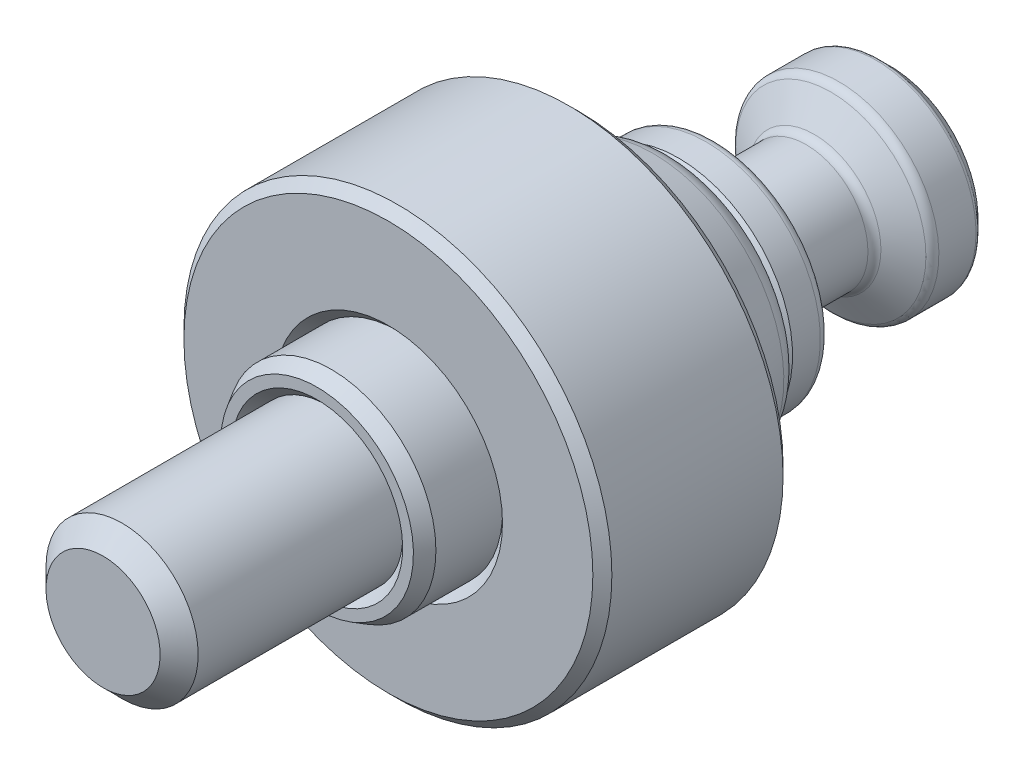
ISO-10303-21;
HEADER;
FILE_DESCRIPTION(('STEP AP214'),'2;1');
FILE_NAME('part.step','',(''),(''),'','','');
FILE_SCHEMA(('AUTOMOTIVE_DESIGN { 1 0 10303 214 1 1 1 1 }'));
ENDSEC;
DATA;
#1=APPLICATION_CONTEXT('core data for automotive mechanical design processes');
#2=APPLICATION_PROTOCOL_DEFINITION('international standard','automotive_design',2000,#1);
#3=PRODUCT_CONTEXT('',#1,'mechanical');
#4=PRODUCT('Part','Part','',(#3));
#5=PRODUCT_RELATED_PRODUCT_CATEGORY('part','',(#4));
#6=PRODUCT_DEFINITION_FORMATION('','',#4);
#7=PRODUCT_DEFINITION_CONTEXT('part definition',#1,'design');
#8=PRODUCT_DEFINITION('design','',#6,#7);
#9=PRODUCT_DEFINITION_SHAPE('','',#8);
#10=(LENGTH_UNIT() NAMED_UNIT(*) SI_UNIT(.MILLI.,.METRE.));
#11=(NAMED_UNIT(*) PLANE_ANGLE_UNIT() SI_UNIT($,.RADIAN.));
#12=(NAMED_UNIT(*) SI_UNIT($,.STERADIAN.) SOLID_ANGLE_UNIT());
#13=UNCERTAINTY_MEASURE_WITH_UNIT(LENGTH_MEASURE(1.E-05),#10,'distance_accuracy_value','');
#14=(GEOMETRIC_REPRESENTATION_CONTEXT(3) GLOBAL_UNCERTAINTY_ASSIGNED_CONTEXT((#13)) GLOBAL_UNIT_ASSIGNED_CONTEXT((#10,
#11,#12)) REPRESENTATION_CONTEXT('',''));
#15=CARTESIAN_POINT('',(0.,0.,0.));
#16=DIRECTION('',(0.,0.,1.));
#17=DIRECTION('',(1.,0.,0.));
#18=AXIS2_PLACEMENT_3D('',#15,#16,#17);
#19=CARTESIAN_POINT('',(0.,0.,20.));
#20=DIRECTION('',(0.,0.,1.));
#21=DIRECTION('',(-1.,0.,0.));
#22=AXIS2_PLACEMENT_3D('',#19,#20,#21);
#23=CONICAL_SURFACE('',#22,12.,0.785398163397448);
#24=CARTESIAN_POINT('',(0.,0.,19.));
#25=DIRECTION('',(0.,0.,1.));
#26=DIRECTION('',(-1.,0.,0.));
#27=AXIS2_PLACEMENT_3D('',#24,#25,#26);
#28=CIRCLE('',#27,11.);
#29=CARTESIAN_POINT('',(-11.,0.,19.));
#30=VERTEX_POINT('',#29);
#31=EDGE_CURVE('E724',#30,#30,#28,.T.);
#32=ORIENTED_EDGE('',*,*,#31,.F.);
#33=EDGE_LOOP('',(#32));
#34=FACE_BOUND('',#33,.T.);
#35=CARTESIAN_POINT('',(0.,0.,20.));
#36=DIRECTION('',(0.,0.,1.));
#37=DIRECTION('',(-1.,0.,0.));
#38=AXIS2_PLACEMENT_3D('',#35,#36,#37);
#39=CIRCLE('',#38,12.);
#40=CARTESIAN_POINT('',(-12.,0.,20.));
#41=VERTEX_POINT('',#40);
#42=EDGE_CURVE('E730',#41,#41,#39,.F.);
#43=ORIENTED_EDGE('',*,*,#42,.F.);
#44=EDGE_LOOP('',(#43));
#45=FACE_BOUND('',#44,.T.);
#46=ADVANCED_FACE('F15',(#34,#45),#23,.F.);
#47=CARTESIAN_POINT('',(11.0000000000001,0.,20.));
#48=DIRECTION('',(0.,0.,1.));
#49=DIRECTION('',(-1.,0.,0.));
#50=AXIS2_PLACEMENT_3D('',#47,#48,#49);
#51=PLANE('',#50);
#52=ORIENTED_EDGE('',*,*,#42,.T.);
#53=EDGE_LOOP('',(#52));
#54=FACE_BOUND('',#53,.T.);
#55=CARTESIAN_POINT('',(0.,0.,20.));
#56=DIRECTION('',(0.,0.,1.));
#57=DIRECTION('',(-1.,0.,0.));
#58=AXIS2_PLACEMENT_3D('',#55,#56,#57);
#59=CIRCLE('',#58,21.5);
#60=CARTESIAN_POINT('',(-21.5,0.,20.));
#61=VERTEX_POINT('',#60);
#62=EDGE_CURVE('E716',#61,#61,#59,.T.);
#63=ORIENTED_EDGE('',*,*,#62,.T.);
#64=EDGE_LOOP('',(#63));
#65=FACE_BOUND('',#64,.T.);
#66=ADVANCED_FACE('F313',(#54,#65),#51,.T.);
#67=CARTESIAN_POINT('',(0.,0.,19.));
#68=DIRECTION('',(0.,0.,-1.));
#69=DIRECTION('',(1.,0.,0.));
#70=AXIS2_PLACEMENT_3D('',#67,#68,#69);
#71=CONICAL_SURFACE('',#70,22.5,0.78539816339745);
#72=ORIENTED_EDGE('',*,*,#62,.F.);
#73=EDGE_LOOP('',(#72));
#74=FACE_BOUND('',#73,.T.);
#75=CARTESIAN_POINT('',(0.,0.,19.));
#76=DIRECTION('',(0.,0.,1.));
#77=DIRECTION('',(-1.,0.,0.));
#78=AXIS2_PLACEMENT_3D('',#75,#76,#77);
#79=CIRCLE('',#78,22.5);
#80=CARTESIAN_POINT('',(-22.5,0.,19.));
#81=VERTEX_POINT('',#80);
#82=EDGE_CURVE('E712',#81,#81,#79,.F.);
#83=ORIENTED_EDGE('',*,*,#82,.F.);
#84=EDGE_LOOP('',(#83));
#85=FACE_BOUND('',#84,.T.);
#86=ADVANCED_FACE('F324',(#74,#85),#71,.T.);
#87=CARTESIAN_POINT('',(22.5,0.,-1.19379064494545E-13));
#88=DIRECTION('',(0.,0.,-1.));
#89=DIRECTION('',(1.,0.,0.));
#90=AXIS2_PLACEMENT_3D('',#87,#88,#89);
#91=PLANE('',#90);
#92=CARTESIAN_POINT('',(0.,0.,-1.19370659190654E-13));
#93=DIRECTION('',(0.,0.,-1.));
#94=DIRECTION('',(-1.,0.,0.));
#95=AXIS2_PLACEMENT_3D('',#92,#93,#94);
#96=CIRCLE('',#95,15.55);
#97=CARTESIAN_POINT('',(-15.55,0.,-1.19370659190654E-13));
#98=VERTEX_POINT('',#97);
#99=EDGE_CURVE('E9',#98,#98,#96,.T.);
#100=ORIENTED_EDGE('',*,*,#99,.F.);
#101=EDGE_LOOP('',(#100));
#102=FACE_BOUND('',#101,.T.);
#103=CARTESIAN_POINT('',(0.,0.,-1.19379064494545E-13));
#104=DIRECTION('',(0.,0.,-1.));
#105=DIRECTION('',(1.,0.,0.));
#106=AXIS2_PLACEMENT_3D('',#103,#104,#105);
#107=CIRCLE('',#106,21.5);
#108=CARTESIAN_POINT('',(21.5,0.,-1.19379064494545E-13));
#109=VERTEX_POINT('',#108);
#110=EDGE_CURVE('E721',#109,#109,#107,.T.);
#111=ORIENTED_EDGE('',*,*,#110,.T.);
#112=EDGE_LOOP('',(#111));
#113=FACE_BOUND('',#112,.T.);
#114=ADVANCED_FACE('F322',(#102,#113),#91,.T.);
#115=CARTESIAN_POINT('',(0.,0.,-1.19379064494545E-13));
#116=DIRECTION('',(0.,0.,1.));
#117=DIRECTION('',(-1.,0.,0.));
#118=AXIS2_PLACEMENT_3D('',#115,#116,#117);
#119=CONICAL_SURFACE('',#118,21.5,0.785398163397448);
#120=CARTESIAN_POINT('',(0.,0.,0.999999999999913));
#121=DIRECTION('',(0.,0.,-1.));
#122=DIRECTION('',(1.,0.,0.));
#123=AXIS2_PLACEMENT_3D('',#120,#121,#122);
#124=CIRCLE('',#123,22.5);
#125=CARTESIAN_POINT('',(22.5,0.,0.999999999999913));
#126=VERTEX_POINT('',#125);
#127=EDGE_CURVE('E185',#126,#126,#124,.F.);
#128=ORIENTED_EDGE('',*,*,#127,.F.);
#129=EDGE_LOOP('',(#128));
#130=FACE_BOUND('',#129,.T.);
#131=ORIENTED_EDGE('',*,*,#110,.F.);
#132=EDGE_LOOP('',(#131));
#133=FACE_BOUND('',#132,.T.);
#134=ADVANCED_FACE('F318',(#130,#133),#119,.T.);
#135=CARTESIAN_POINT('',(0.,0.,0.));
#136=DIRECTION('',(0.,0.,-1.));
#137=DIRECTION('',(1.,0.,0.));
#138=AXIS2_PLACEMENT_3D('',#135,#136,#137);
#139=CYLINDRICAL_SURFACE('',#138,22.5);
#140=ORIENTED_EDGE('',*,*,#82,.T.);
#141=EDGE_LOOP('',(#140));
#142=FACE_BOUND('',#141,.T.);
#143=ORIENTED_EDGE('',*,*,#127,.T.);
#144=EDGE_LOOP('',(#143));
#145=FACE_BOUND('',#144,.T.);
#146=ADVANCED_FACE('F321',(#142,#145),#139,.T.);
#147=CARTESIAN_POINT('',(0.,0.,-0.199999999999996));
#148=DIRECTION('',(0.,0.,-1.));
#149=DIRECTION('',(0.,1.,0.));
#150=AXIS2_PLACEMENT_3D('',#147,#148,#149);
#151=CONICAL_SURFACE('',#150,15.75,0.785398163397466);
#152=ORIENTED_EDGE('',*,*,#99,.T.);
#153=EDGE_LOOP('',(#152));
#154=FACE_BOUND('',#153,.T.);
#155=CARTESIAN_POINT('',(0.,0.,-0.199999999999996));
#156=DIRECTION('',(0.,0.,1.));
#157=DIRECTION('',(0.,-1.,0.));
#158=AXIS2_PLACEMENT_3D('',#155,#156,#157);
#159=CIRCLE('',#158,15.75);
#160=CARTESIAN_POINT('',(0.,-15.75,-0.199999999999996));
#161=VERTEX_POINT('',#160);
#162=EDGE_CURVE('E182',#161,#161,#159,.F.);
#163=ORIENTED_EDGE('',*,*,#162,.F.);
#164=EDGE_LOOP('',(#163));
#165=FACE_BOUND('',#164,.T.);
#166=ADVANCED_FACE('F210',(#154,#165),#151,.T.);
#167=CARTESIAN_POINT('',(0.,0.,0.));
#168=DIRECTION('',(0.,0.,-1.));
#169=DIRECTION('',(0.,1.,0.));
#170=AXIS2_PLACEMENT_3D('',#167,#168,#169);
#171=CYLINDRICAL_SURFACE('',#170,15.75);
#172=ORIENTED_EDGE('',*,*,#162,.T.);
#173=EDGE_LOOP('',(#172));
#174=FACE_BOUND('',#173,.T.);
#175=CARTESIAN_POINT('',(0.,0.,-0.871853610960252));
#176=DIRECTION('',(0.,0.,-1.));
#177=DIRECTION('',(0.,1.,0.));
#178=AXIS2_PLACEMENT_3D('',#175,#176,#177);
#179=CIRCLE('',#178,15.75);
#180=CARTESIAN_POINT('',(0.,15.75,-0.871853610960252));
#181=VERTEX_POINT('',#180);
#182=EDGE_CURVE('E156',#181,#181,#179,.T.);
#183=ORIENTED_EDGE('',*,*,#182,.F.);
#184=EDGE_LOOP('',(#183));
#185=FACE_BOUND('',#184,.T.);
#186=ADVANCED_FACE('F301',(#174,#185),#171,.T.);
#187=CARTESIAN_POINT('',(0.,0.,-10.));
#188=DIRECTION('',(0.,0.,1.));
#189=DIRECTION('',(0.,-1.,0.));
#190=AXIS2_PLACEMENT_3D('',#187,#188,#189);
#191=CONICAL_SURFACE('',#190,13.132546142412,0.279252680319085);
#192=CARTESIAN_POINT('',(0.,0.,-7.82691206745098));
#193=DIRECTION('',(0.,0.,-1.));
#194=DIRECTION('',(0.,1.,0.));
#195=AXIS2_PLACEMENT_3D('',#192,#193,#194);
#196=CIRCLE('',#195,13.7556690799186);
#197=CARTESIAN_POINT('',(0.,13.7556690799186,-7.82691206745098));
#198=VERTEX_POINT('',#197);
#199=EDGE_CURVE('E167',#198,#198,#196,.F.);
#200=ORIENTED_EDGE('',*,*,#199,.T.);
#201=EDGE_LOOP('',(#200));
#202=FACE_BOUND('',#201,.T.);
#203=ORIENTED_EDGE('',*,*,#182,.T.);
#204=EDGE_LOOP('',(#203));
#205=FACE_BOUND('',#204,.T.);
#206=ADVANCED_FACE('F289',(#202,#205),#191,.T.);
#207=CARTESIAN_POINT('',(0.,0.,-7.));
#208=DIRECTION('',(0.,0.,-1.));
#209=DIRECTION('',(0.,1.,0.));
#210=AXIS2_PLACEMENT_3D('',#207,#208,#209);
#211=TOROIDAL_SURFACE('',#210,10.8718839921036,3.);
#212=ORIENTED_EDGE('',*,*,#199,.F.);
#213=EDGE_LOOP('',(#212));
#214=FACE_BOUND('',#213,.T.);
#215=CARTESIAN_POINT('',(0.,0.,-10.));
#216=DIRECTION('',(0.,0.,-1.));
#217=DIRECTION('',(0.,1.,0.));
#218=AXIS2_PLACEMENT_3D('',#215,#216,#217);
#219=CIRCLE('',#218,10.8718839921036);
#220=CARTESIAN_POINT('',(0.,10.8718839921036,-10.));
#221=VERTEX_POINT('',#220);
#222=EDGE_CURVE('E161',#221,#221,#219,.T.);
#223=ORIENTED_EDGE('',*,*,#222,.F.);
#224=EDGE_LOOP('',(#223));
#225=FACE_BOUND('',#224,.T.);
#226=ADVANCED_FACE('F285',(#214,#225),#211,.T.);
#227=CARTESIAN_POINT('',(-8.,0.,-10.));
#228=DIRECTION('',(0.,0.,1.));
#229=DIRECTION('',(0.,1.,0.));
#230=AXIS2_PLACEMENT_3D('',#227,#228,#229);
#231=PLANE('',#230);
#232=ORIENTED_EDGE('',*,*,#222,.T.);
#233=EDGE_LOOP('',(#232));
#234=FACE_BOUND('',#233,.T.);
#235=CARTESIAN_POINT('',(0.,0.,-10.));
#236=DIRECTION('',(0.,0.,1.));
#237=DIRECTION('',(0.,1.,0.));
#238=AXIS2_PLACEMENT_3D('',#235,#236,#237);
#239=CIRCLE('',#238,11.5);
#240=CARTESIAN_POINT('',(0.,11.5,-10.));
#241=VERTEX_POINT('',#240);
#242=EDGE_CURVE('E93',#241,#241,#239,.T.);
#243=ORIENTED_EDGE('',*,*,#242,.T.);
#244=EDGE_LOOP('',(#243));
#245=FACE_BOUND('',#244,.T.);
#246=ADVANCED_FACE('F288',(#234,#245),#231,.T.);
#247=CARTESIAN_POINT('',(0.,0.,-10.5));
#248=DIRECTION('',(0.,0.,-1.));
#249=DIRECTION('',(0.,-1.,0.));
#250=AXIS2_PLACEMENT_3D('',#247,#248,#249);
#251=CONICAL_SURFACE('',#250,12.,0.785398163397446);
#252=ORIENTED_EDGE('',*,*,#242,.F.);
#253=EDGE_LOOP('',(#252));
#254=FACE_BOUND('',#253,.T.);
#255=CARTESIAN_POINT('',(0.,0.,-10.5));
#256=DIRECTION('',(0.,0.,1.));
#257=DIRECTION('',(0.,1.,0.));
#258=AXIS2_PLACEMENT_3D('',#255,#256,#257);
#259=CIRCLE('',#258,12.);
#260=CARTESIAN_POINT('',(0.,12.,-10.5));
#261=VERTEX_POINT('',#260);
#262=EDGE_CURVE('E90',#261,#261,#259,.F.);
#263=ORIENTED_EDGE('',*,*,#262,.F.);
#264=EDGE_LOOP('',(#263));
#265=FACE_BOUND('',#264,.T.);
#266=ADVANCED_FACE('F361',(#254,#265),#251,.T.);
#267=CARTESIAN_POINT('',(0.,0.,-10.));
#268=DIRECTION('',(0.,0.,-1.));
#269=DIRECTION('',(0.,-1.,0.));
#270=AXIS2_PLACEMENT_3D('',#267,#268,#269);
#271=CYLINDRICAL_SURFACE('',#270,12.);
#272=CARTESIAN_POINT('',(0.,0.,-13.4226497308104));
#273=DIRECTION('',(0.,0.,-1.));
#274=DIRECTION('',(0.,-1.,0.));
#275=AXIS2_PLACEMENT_3D('',#272,#273,#274);
#276=CIRCLE('',#275,12.);
#277=CARTESIAN_POINT('',(0.,-12.,-13.4226497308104));
#278=VERTEX_POINT('',#277);
#279=EDGE_CURVE('E142',#278,#278,#276,.F.);
#280=ORIENTED_EDGE('',*,*,#279,.T.);
#281=EDGE_LOOP('',(#280));
#282=FACE_BOUND('',#281,.T.);
#283=ORIENTED_EDGE('',*,*,#262,.T.);
#284=EDGE_LOOP('',(#283));
#285=FACE_BOUND('',#284,.T.);
#286=ADVANCED_FACE('F261',(#282,#285),#271,.T.);
#287=CARTESIAN_POINT('',(0.,0.,-13.4226497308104));
#288=DIRECTION('',(0.,0.,-1.));
#289=DIRECTION('',(0.,-1.,0.));
#290=AXIS2_PLACEMENT_3D('',#287,#288,#289);
#291=TOROIDAL_SURFACE('',#290,11.,1.);
#292=CARTESIAN_POINT('',(0.,0.,-14.2886751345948));
#293=DIRECTION('',(0.,0.,-1.));
#294=DIRECTION('',(0.,-1.,0.));
#295=AXIS2_PLACEMENT_3D('',#292,#293,#294);
#296=CIRCLE('',#295,11.5);
#297=CARTESIAN_POINT('',(0.,-11.5,-14.2886751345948));
#298=VERTEX_POINT('',#297);
#299=EDGE_CURVE('E145',#298,#298,#296,.T.);
#300=ORIENTED_EDGE('',*,*,#299,.F.);
#301=EDGE_LOOP('',(#300));
#302=FACE_BOUND('',#301,.T.);
#303=ORIENTED_EDGE('',*,*,#279,.F.);
#304=EDGE_LOOP('',(#303));
#305=FACE_BOUND('',#304,.T.);
#306=ADVANCED_FACE('F254',(#302,#305),#291,.T.);
#307=CARTESIAN_POINT('',(0.,0.,-14.));
#308=DIRECTION('',(0.,0.,1.));
#309=DIRECTION('',(0.,1.,0.));
#310=AXIS2_PLACEMENT_3D('',#307,#308,#309);
#311=CONICAL_SURFACE('',#310,12.,1.0471975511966);
#312=ORIENTED_EDGE('',*,*,#299,.T.);
#313=EDGE_LOOP('',(#312));
#314=FACE_BOUND('',#313,.T.);
#315=CARTESIAN_POINT('',(0.,0.,-16.8867513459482));
#316=DIRECTION('',(0.,0.,1.));
#317=DIRECTION('',(0.,1.,0.));
#318=AXIS2_PLACEMENT_3D('',#315,#316,#317);
#319=CIRCLE('',#318,7.);
#320=CARTESIAN_POINT('',(0.,7.,-16.8867513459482));
#321=VERTEX_POINT('',#320);
#322=EDGE_CURVE('E121',#321,#321,#319,.T.);
#323=ORIENTED_EDGE('',*,*,#322,.T.);
#324=EDGE_LOOP('',(#323));
#325=FACE_BOUND('',#324,.T.);
#326=ADVANCED_FACE('F260',(#314,#325),#311,.T.);
#327=CARTESIAN_POINT('',(0.,0.,-17.7527767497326));
#328=DIRECTION('',(0.,0.,1.));
#329=DIRECTION('',(0.,1.,0.));
#330=AXIS2_PLACEMENT_3D('',#327,#328,#329);
#331=TOROIDAL_SURFACE('',#330,7.5,1.);
#332=CARTESIAN_POINT('',(0.,0.,-17.7527767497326));
#333=DIRECTION('',(0.,0.,1.));
#334=DIRECTION('',(0.,1.,0.));
#335=AXIS2_PLACEMENT_3D('',#332,#333,#334);
#336=CIRCLE('',#335,6.5);
#337=CARTESIAN_POINT('',(0.,6.5,-17.7527767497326));
#338=VERTEX_POINT('',#337);
#339=EDGE_CURVE('E112',#338,#338,#336,.F.);
#340=ORIENTED_EDGE('',*,*,#339,.F.);
#341=EDGE_LOOP('',(#340));
#342=FACE_BOUND('',#341,.T.);
#343=ORIENTED_EDGE('',*,*,#322,.F.);
#344=EDGE_LOOP('',(#343));
#345=FACE_BOUND('',#344,.T.);
#346=ADVANCED_FACE('F374',(#342,#345),#331,.F.);
#347=CARTESIAN_POINT('',(0.,0.,-10.));
#348=DIRECTION('',(0.,0.,1.));
#349=DIRECTION('',(0.,1.,0.));
#350=AXIS2_PLACEMENT_3D('',#347,#348,#349);
#351=CYLINDRICAL_SURFACE('',#350,6.5);
#352=CARTESIAN_POINT('',(0.,0.,-23.9226497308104));
#353=DIRECTION('',(0.,0.,1.));
#354=DIRECTION('',(0.,1.,0.));
#355=AXIS2_PLACEMENT_3D('',#352,#353,#354);
#356=CIRCLE('',#355,6.5);
#357=CARTESIAN_POINT('',(0.,6.5,-23.9226497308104));
#358=VERTEX_POINT('',#357);
#359=EDGE_CURVE('E115',#358,#358,#356,.T.);
#360=ORIENTED_EDGE('',*,*,#359,.T.);
#361=EDGE_LOOP('',(#360));
#362=FACE_BOUND('',#361,.T.);
#363=ORIENTED_EDGE('',*,*,#339,.T.);
#364=EDGE_LOOP('',(#363));
#365=FACE_BOUND('',#364,.T.);
#366=ADVANCED_FACE('F353',(#362,#365),#351,.T.);
#367=CARTESIAN_POINT('',(0.,0.,-23.9226497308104));
#368=DIRECTION('',(0.,0.,1.));
#369=DIRECTION('',(0.,1.,0.));
#370=AXIS2_PLACEMENT_3D('',#367,#368,#369);
#371=TOROIDAL_SURFACE('',#370,7.5,1.);
#372=CARTESIAN_POINT('',(0.,0.,-24.7886751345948));
#373=DIRECTION('',(0.,0.,-1.));
#374=DIRECTION('',(0.,-1.,0.));
#375=AXIS2_PLACEMENT_3D('',#372,#373,#374);
#376=CIRCLE('',#375,7.);
#377=CARTESIAN_POINT('',(0.,-7.,-24.7886751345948));
#378=VERTEX_POINT('',#377);
#379=EDGE_CURVE('E118',#378,#378,#376,.T.);
#380=ORIENTED_EDGE('',*,*,#379,.F.);
#381=EDGE_LOOP('',(#380));
#382=FACE_BOUND('',#381,.T.);
#383=ORIENTED_EDGE('',*,*,#359,.F.);
#384=EDGE_LOOP('',(#383));
#385=FACE_BOUND('',#384,.T.);
#386=ADVANCED_FACE('F369',(#382,#385),#371,.F.);
#387=CARTESIAN_POINT('',(0.,0.,-24.5));
#388=DIRECTION('',(0.,0.,-1.));
#389=DIRECTION('',(0.,-1.,0.));
#390=AXIS2_PLACEMENT_3D('',#387,#388,#389);
#391=CONICAL_SURFACE('',#390,6.5,1.0471975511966);
#392=CARTESIAN_POINT('',(0.,0.,-26.5207259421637));
#393=DIRECTION('',(0.,0.,1.));
#394=DIRECTION('',(0.,1.,0.));
#395=AXIS2_PLACEMENT_3D('',#392,#393,#394);
#396=CIRCLE('',#395,10.);
#397=CARTESIAN_POINT('',(0.,10.,-26.5207259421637));
#398=VERTEX_POINT('',#397);
#399=EDGE_CURVE('E147',#398,#398,#396,.T.);
#400=ORIENTED_EDGE('',*,*,#399,.T.);
#401=EDGE_LOOP('',(#400));
#402=FACE_BOUND('',#401,.T.);
#403=ORIENTED_EDGE('',*,*,#379,.T.);
#404=EDGE_LOOP('',(#403));
#405=FACE_BOUND('',#404,.T.);
#406=ADVANCED_FACE('F372',(#402,#405),#391,.T.);
#407=CARTESIAN_POINT('',(0.,0.,-27.3867513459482));
#408=DIRECTION('',(0.,0.,-1.));
#409=DIRECTION('',(0.,-1.,0.));
#410=AXIS2_PLACEMENT_3D('',#407,#408,#409);
#411=TOROIDAL_SURFACE('',#410,9.5,1.);
#412=CARTESIAN_POINT('',(0.,0.,-27.3867513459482));
#413=DIRECTION('',(0.,0.,-1.));
#414=DIRECTION('',(0.,-1.,0.));
#415=AXIS2_PLACEMENT_3D('',#412,#413,#414);
#416=CIRCLE('',#415,10.5);
#417=CARTESIAN_POINT('',(0.,-10.5,-27.3867513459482));
#418=VERTEX_POINT('',#417);
#419=EDGE_CURVE('E19',#418,#418,#416,.T.);
#420=ORIENTED_EDGE('',*,*,#419,.F.);
#421=EDGE_LOOP('',(#420));
#422=FACE_BOUND('',#421,.T.);
#423=ORIENTED_EDGE('',*,*,#399,.F.);
#424=EDGE_LOOP('',(#423));
#425=FACE_BOUND('',#424,.T.);
#426=ADVANCED_FACE('F17',(#422,#425),#411,.T.);
#427=CARTESIAN_POINT('',(0.,0.,-10.));
#428=DIRECTION('',(0.,0.,1.));
#429=DIRECTION('',(0.,1.,0.));
#430=AXIS2_PLACEMENT_3D('',#427,#428,#429);
#431=CYLINDRICAL_SURFACE('',#430,10.5);
#432=ORIENTED_EDGE('',*,*,#419,.T.);
#433=EDGE_LOOP('',(#432));
#434=FACE_BOUND('',#433,.T.);
#435=CARTESIAN_POINT('',(0.,0.,-31.2928932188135));
#436=DIRECTION('',(0.,0.,-1.));
#437=DIRECTION('',(0.,-1.,0.));
#438=AXIS2_PLACEMENT_3D('',#435,#436,#437);
#439=CIRCLE('',#438,10.5);
#440=CARTESIAN_POINT('',(0.,-10.5,-31.2928932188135));
#441=VERTEX_POINT('',#440);
#442=EDGE_CURVE('E124',#441,#441,#439,.F.);
#443=ORIENTED_EDGE('',*,*,#442,.T.);
#444=EDGE_LOOP('',(#443));
#445=FACE_BOUND('',#444,.T.);
#446=ADVANCED_FACE('F358',(#434,#445),#431,.T.);
#447=CARTESIAN_POINT('',(0.,0.,-31.2928932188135));
#448=DIRECTION('',(0.,0.,-1.));
#449=DIRECTION('',(0.,-1.,0.));
#450=AXIS2_PLACEMENT_3D('',#447,#448,#449);
#451=TOROIDAL_SURFACE('',#450,10.,0.5);
#452=CARTESIAN_POINT('',(0.,0.,-31.6464466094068));
#453=DIRECTION('',(0.,0.,-1.));
#454=DIRECTION('',(0.,-1.,0.));
#455=AXIS2_PLACEMENT_3D('',#452,#453,#454);
#456=CIRCLE('',#455,10.3535533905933);
#457=CARTESIAN_POINT('',(0.,-10.3535533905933,-31.6464466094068));
#458=VERTEX_POINT('',#457);
#459=EDGE_CURVE('E127',#458,#458,#456,.T.);
#460=ORIENTED_EDGE('',*,*,#459,.F.);
#461=EDGE_LOOP('',(#460));
#462=FACE_BOUND('',#461,.T.);
#463=ORIENTED_EDGE('',*,*,#442,.F.);
#464=EDGE_LOOP('',(#463));
#465=FACE_BOUND('',#464,.T.);
#466=ADVANCED_FACE('F378',(#462,#465),#451,.T.);
#467=CARTESIAN_POINT('',(0.,0.,-31.5));
#468=DIRECTION('',(0.,0.,1.));
#469=DIRECTION('',(0.,1.,0.));
#470=AXIS2_PLACEMENT_3D('',#467,#468,#469);
#471=CONICAL_SURFACE('',#470,10.5,0.785398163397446);
#472=CARTESIAN_POINT('',(0.,0.,-32.7071067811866));
#473=DIRECTION('',(0.,0.,-1.));
#474=DIRECTION('',(0.,-1.,0.));
#475=AXIS2_PLACEMENT_3D('',#472,#473,#474);
#476=CIRCLE('',#475,9.29289321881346);
#477=CARTESIAN_POINT('',(0.,-9.29289321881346,-32.7071067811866));
#478=VERTEX_POINT('',#477);
#479=EDGE_CURVE('E136',#478,#478,#476,.F.);
#480=ORIENTED_EDGE('',*,*,#479,.T.);
#481=EDGE_LOOP('',(#480));
#482=FACE_BOUND('',#481,.T.);
#483=ORIENTED_EDGE('',*,*,#459,.T.);
#484=EDGE_LOOP('',(#483));
#485=FACE_BOUND('',#484,.T.);
#486=ADVANCED_FACE('F212',(#482,#485),#471,.T.);
#487=CARTESIAN_POINT('',(0.,0.,-32.));
#488=DIRECTION('',(0.,0.,-1.));
#489=DIRECTION('',(0.,-1.,0.));
#490=AXIS2_PLACEMENT_3D('',#487,#488,#489);
#491=TOROIDAL_SURFACE('',#490,8.58578643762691,1.);
#492=CARTESIAN_POINT('',(0.,0.,-33.));
#493=DIRECTION('',(0.,0.,-1.));
#494=DIRECTION('',(0.,-1.,0.));
#495=AXIS2_PLACEMENT_3D('',#492,#493,#494);
#496=CIRCLE('',#495,8.58578643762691);
#497=CARTESIAN_POINT('',(0.,-8.58578643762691,-33.));
#498=VERTEX_POINT('',#497);
#499=EDGE_CURVE('E139',#498,#498,#496,.T.);
#500=ORIENTED_EDGE('',*,*,#499,.F.);
#501=EDGE_LOOP('',(#500));
#502=FACE_BOUND('',#501,.T.);
#503=ORIENTED_EDGE('',*,*,#479,.F.);
#504=EDGE_LOOP('',(#503));
#505=FACE_BOUND('',#504,.T.);
#506=ADVANCED_FACE('F209',(#502,#505),#491,.T.);
#507=CARTESIAN_POINT('',(-12.,0.,-33.));
#508=DIRECTION('',(0.,0.,-1.));
#509=DIRECTION('',(0.,-1.,0.));
#510=AXIS2_PLACEMENT_3D('',#507,#508,#509);
#511=PLANE('',#510);
#512=ORIENTED_EDGE('',*,*,#499,.T.);
#513=EDGE_LOOP('',(#512));
#514=FACE_BOUND('',#513,.T.);
#515=CARTESIAN_POINT('',(0.,0.,-33.));
#516=DIRECTION('',(0.,0.,1.));
#517=DIRECTION('',(0.,1.,0.));
#518=AXIS2_PLACEMENT_3D('',#515,#516,#517);
#519=CIRCLE('',#518,3.75);
#520=CARTESIAN_POINT('',(0.,3.75,-33.));
#521=VERTEX_POINT('',#520);
#522=EDGE_CURVE('E77',#521,#521,#519,.T.);
#523=ORIENTED_EDGE('',*,*,#522,.T.);
#524=EDGE_LOOP('',(#523));
#525=FACE_BOUND('',#524,.T.);
#526=ADVANCED_FACE('F207',(#514,#525),#511,.T.);
#527=CARTESIAN_POINT('',(0.,0.,-33.));
#528=DIRECTION('',(0.,0.,-1.));
#529=DIRECTION('',(0.,-1.,0.));
#530=AXIS2_PLACEMENT_3D('',#527,#528,#529);
#531=CONICAL_SURFACE('',#530,3.75,1.0471975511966);
#532=ORIENTED_EDGE('',*,*,#522,.F.);
#533=EDGE_LOOP('',(#532));
#534=FACE_BOUND('',#533,.T.);
#535=CARTESIAN_POINT('',(-1.73193533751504,3.0002,-32.8350031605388));
#536=CARTESIAN_POINT('',(-1.80805042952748,2.86836479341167,-32.7910410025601));
#537=CARTESIAN_POINT('',(-1.88482254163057,2.73539159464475,-32.7510588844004));
#538=CARTESIAN_POINT('',(-2.03969618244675,2.46714257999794,-32.6812693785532));
#539=CARTESIAN_POINT('',(-2.11780046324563,2.33186199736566,-32.6514866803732));
#540=CARTESIAN_POINT('',(-2.27304105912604,2.06297739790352,-32.605125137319));
#541=CARTESIAN_POINT('',(-2.35015348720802,1.92941475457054,-32.5882377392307));
#542=CARTESIAN_POINT('',(-2.50474122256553,1.66166094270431,-32.5680769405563));
#543=CARTESIAN_POINT('',(-2.58221596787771,1.52747074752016,-32.5647868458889));
#544=CARTESIAN_POINT('',(-2.72698443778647,1.27672440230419,-32.5716278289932));
#545=CARTESIAN_POINT('',(-2.79429982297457,1.16013073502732,-32.5800792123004));
#546=CARTESIAN_POINT('',(-2.92849202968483,0.927703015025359,-32.6068662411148));
#547=CARTESIAN_POINT('',(-2.99536838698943,0.811869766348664,-32.6252110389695));
#548=CARTESIAN_POINT('',(-3.12983731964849,0.578962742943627,-32.6710720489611));
#549=CARTESIAN_POINT('',(-3.19741287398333,0.461918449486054,-32.6987826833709));
#550=CARTESIAN_POINT('',(-3.33155605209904,0.229575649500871,-32.7616750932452));
#551=CARTESIAN_POINT('',(-3.39812539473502,0.11427416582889,-32.7968420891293));
#552=CARTESIAN_POINT('',(-3.4642170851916,-0.000200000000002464,-32.8350031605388));
#553=B_SPLINE_CURVE_WITH_KNOTS('',3,(#535,#536,#537,#538,#539,#540,#541,#542,#543,#544,#545,
#546,#547,#548,#549,#550,#551,#552),.UNSPECIFIED.,.F.,.F.,(4,2,2,2,2,2,2,2,4),(0.,
0.475539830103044,0.952222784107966,1.41710776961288,1.88142182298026,2.28572436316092,
2.6904015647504,3.10405572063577,3.51689749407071),.UNSPECIFIED.);
#554=CARTESIAN_POINT('',(-1.73205080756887,3.,-32.8349364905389));
#555=VERTEX_POINT('',#554);
#556=CARTESIAN_POINT('',(-3.46410161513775,0.,-32.8349364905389));
#557=VERTEX_POINT('',#556);
#558=EDGE_CURVE('E33',#555,#557,#553,.T.);
#559=ORIENTED_EDGE('',*,*,#558,.T.);
#560=CARTESIAN_POINT('',(-3.4642170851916,0.000199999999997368,-32.8350031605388));
#561=CARTESIAN_POINT('',(-3.38810199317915,-0.131635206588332,-32.7910410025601));
#562=CARTESIAN_POINT('',(-3.31132988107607,-0.26460840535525,-32.7510588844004));
#563=CARTESIAN_POINT('',(-3.15645624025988,-0.532857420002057,-32.6812693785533));
#564=CARTESIAN_POINT('',(-3.078351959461,-0.668138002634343,-32.6514866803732));
#565=CARTESIAN_POINT('',(-2.92311136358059,-0.937022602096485,-32.605125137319));
#566=CARTESIAN_POINT('',(-2.84599893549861,-1.07058524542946,-32.5882377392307));
#567=CARTESIAN_POINT('',(-2.6914112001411,-1.33833905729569,-32.5680769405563));
#568=CARTESIAN_POINT('',(-2.61393645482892,-1.47252925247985,-32.5647868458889));
#569=CARTESIAN_POINT('',(-2.46916798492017,-1.72327559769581,-32.5716278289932));
#570=CARTESIAN_POINT('',(-2.40185259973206,-1.83986926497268,-32.5800792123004));
#571=CARTESIAN_POINT('',(-2.2676603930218,-2.07229698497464,-32.6068662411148));
#572=CARTESIAN_POINT('',(-2.2007840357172,-2.18813023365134,-32.6252110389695));
#573=CARTESIAN_POINT('',(-2.06631510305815,-2.42103725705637,-32.6710720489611));
#574=CARTESIAN_POINT('',(-1.99873954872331,-2.53808155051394,-32.6987826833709));
#575=CARTESIAN_POINT('',(-1.86459637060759,-2.77042435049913,-32.7616750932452));
#576=CARTESIAN_POINT('',(-1.79802702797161,-2.88572583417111,-32.7968420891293));
#577=CARTESIAN_POINT('',(-1.73193533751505,-3.0002,-32.8350031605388));
#578=B_SPLINE_CURVE_WITH_KNOTS('',3,(#560,#561,#562,#563,#564,#565,#566,#567,#568,#569,#570,
#571,#572,#573,#574,#575,#576,#577),.UNSPECIFIED.,.F.,.F.,(4,2,2,2,2,2,2,2,4),(0.,
0.475539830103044,0.952222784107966,1.41710776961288,1.88142182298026,2.28572436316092,
2.69040156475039,3.10405572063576,3.5168974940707),.UNSPECIFIED.);
#579=CARTESIAN_POINT('',(-1.73205080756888,-3.,-32.8349364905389));
#580=VERTEX_POINT('',#579);
#581=EDGE_CURVE('E68',#557,#580,#578,.T.);
#582=ORIENTED_EDGE('',*,*,#581,.T.);
#583=CARTESIAN_POINT('',(4.57816394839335,-3.,-33.9950833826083));
#584=CARTESIAN_POINT('',(4.44770534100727,-3.,-33.9321019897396));
#585=CARTESIAN_POINT('',(4.3169390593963,-3.,-33.8697465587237));
#586=CARTESIAN_POINT('',(4.05462715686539,-3.,-33.7466413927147));
#587=CARTESIAN_POINT('',(3.92308140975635,-3.,-33.6858919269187));
#588=CARTESIAN_POINT('',(3.65833272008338,-3.,-33.5660308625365));
#589=CARTESIAN_POINT('',(3.52512459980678,-3.,-33.5069306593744));
#590=CARTESIAN_POINT('',(3.2576220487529,-3.,-33.3912515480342));
#591=CARTESIAN_POINT('',(3.12332767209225,-3.,-33.3346725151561));
#592=CARTESIAN_POINT('',(2.84947160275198,-3.,-33.2230876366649));
#593=CARTESIAN_POINT('',(2.70987100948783,-3.,-33.168176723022));
#594=CARTESIAN_POINT('',(2.42900957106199,-3.,-33.0626937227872));
#595=CARTESIAN_POINT('',(2.28774853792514,-3.,-33.0121221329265));
#596=CARTESIAN_POINT('',(2.00363062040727,-3.,-32.9166996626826));
#597=CARTESIAN_POINT('',(1.86077789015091,-3.,-32.871836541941));
#598=CARTESIAN_POINT('',(1.57302582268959,-3.,-32.789318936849));
#599=CARTESIAN_POINT('',(1.4281271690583,-3.,-32.7516621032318));
#600=CARTESIAN_POINT('',(1.13695389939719,-3.,-32.6855990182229));
#601=CARTESIAN_POINT('',(0.990689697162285,-3.,-32.657147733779));
#602=CARTESIAN_POINT('',(0.696423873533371,-3.,-32.6111671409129));
#603=CARTESIAN_POINT('',(0.548422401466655,-3.,-32.5936369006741));
#604=CARTESIAN_POINT('',(0.253322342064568,-3.,-32.5711271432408));
#605=CARTESIAN_POINT('',(0.106235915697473,-3.,-32.5659920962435));
#606=CARTESIAN_POINT('',(-0.187849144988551,-3.,-32.568302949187));
#607=CARTESIAN_POINT('',(-0.334847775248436,-3.,-32.5757493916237));
#608=CARTESIAN_POINT('',(-0.586621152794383,-3.,-32.5987632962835));
#609=CARTESIAN_POINT('',(-0.691671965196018,-3.,-32.6114663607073));
#610=CARTESIAN_POINT('',(-0.900950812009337,-3.,-32.6424661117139));
#611=CARTESIAN_POINT('',(-1.00517872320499,-3.,-32.6607636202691));
#612=CARTESIAN_POINT('',(-1.316515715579,-3.,-32.7230802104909));
#613=CARTESIAN_POINT('',(-1.52215497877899,-3.,-32.7745106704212));
#614=CARTESIAN_POINT('',(-1.82965945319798,-3.,-32.8630327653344));
#615=CARTESIAN_POINT('',(-1.93313257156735,-3.,-32.8948509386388));
#616=CARTESIAN_POINT('',(-2.13907223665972,-3.,-32.9616217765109));
#617=CARTESIAN_POINT('',(-2.24153877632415,-3.,-32.9965744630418));
#618=CARTESIAN_POINT('',(-2.4455023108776,-3.,-33.0690674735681));
#619=CARTESIAN_POINT('',(-2.54699964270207,-3.,-33.1066068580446));
#620=CARTESIAN_POINT('',(-2.74916366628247,-3.,-33.1838485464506));
#621=CARTESIAN_POINT('',(-2.84983037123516,-3.,-33.2235508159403));
#622=CARTESIAN_POINT('',(-3.10285866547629,-3.,-33.325976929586));
#623=CARTESIAN_POINT('',(-3.25473921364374,-3.,-33.3898874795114));
#624=CARTESIAN_POINT('',(-3.55712311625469,-3.,-33.5208972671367));
#625=CARTESIAN_POINT('',(-3.70762636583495,-3.,-33.587996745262));
#626=CARTESIAN_POINT('',(-4.00754037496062,-3.,-33.7246828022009));
#627=CARTESIAN_POINT('',(-4.15695085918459,-3.,-33.7942699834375));
#628=CARTESIAN_POINT('',(-4.45485069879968,-3.,-33.9353919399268));
#629=CARTESIAN_POINT('',(-4.60334003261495,-3.,-34.0069267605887));
#630=CARTESIAN_POINT('',(-5.04803783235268,-3.,-34.224009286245));
#631=CARTESIAN_POINT('',(-5.34311674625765,-3.,-34.3718687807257));
#632=CARTESIAN_POINT('',(-5.93116502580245,-3.,-34.6715928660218));
#633=CARTESIAN_POINT('',(-6.22413469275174,-3.,-34.823456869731));
#634=CARTESIAN_POINT('',(-6.78142028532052,-3.,-35.1157233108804));
#635=CARTESIAN_POINT('',(-7.0458664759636,-3.,-35.2558777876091));
#636=CARTESIAN_POINT('',(-7.57386151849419,-3.,-35.5378914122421));
#637=CARTESIAN_POINT('',(-7.83741033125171,-3.,-35.67975063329));
#638=CARTESIAN_POINT('',(-8.36311374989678,-3.,-35.9643722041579));
#639=CARTESIAN_POINT('',(-8.62527019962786,-3.,-36.1071311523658));
#640=CARTESIAN_POINT('',(-9.14901852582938,-3.,-36.3936442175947));
#641=CARTESIAN_POINT('',(-9.4106104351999,-3.,-36.5373982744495));
#642=CARTESIAN_POINT('',(-9.67199904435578,-3.,-36.6815185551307));
#643=B_SPLINE_CURVE_WITH_KNOTS('',3,(#583,#584,#585,#586,#587,#588,#589,#590,#591,#592,#593,
#594,#595,#596,#597,#598,#599,#600,#601,#602,#603,#604,#605,#606,#607,#608,#609,#610,#611,#612,
#613,#614,#615,#616,#617,#618,#619,#620,#621,#622,#623,#624,#625,#626,#627,#628,#629,#630,#631,
#632,#633,#634,#635,#636,#637,#638,#639,#640,#641,#642),.UNSPECIFIED.,.F.,.F.,(4,2,2,2,2,2,2,2,
2,2,2,2,2,2,2,2,2,2,2,2,2,2,2,2,2,2,2,2,2,4),(0.,0.434603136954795,0.869278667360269,
1.3064478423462,1.74359537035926,2.19357500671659,2.64360608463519,3.09265531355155,
3.54155790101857,3.98823005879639,4.43486409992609,4.87586414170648,5.31688319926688,
5.63417619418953,5.9515158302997,6.58656462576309,6.91130347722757,7.23604460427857,
7.56066839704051,7.88528702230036,8.37957333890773,8.87389698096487,9.3683411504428,
9.86279685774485,10.8528958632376,11.842850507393,12.7407149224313,13.6386179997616,
14.5341350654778,15.4295984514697),.UNSPECIFIED.);
#644=CARTESIAN_POINT('',(1.73205080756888,-3.,-32.8349364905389));
#645=VERTEX_POINT('',#644);
#646=EDGE_CURVE('E71',#580,#645,#643,.F.);
#647=ORIENTED_EDGE('',*,*,#646,.T.);
#648=CARTESIAN_POINT('',(1.73193533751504,-3.0002,-32.8350031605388));
#649=CARTESIAN_POINT('',(1.80805042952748,-2.86836479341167,-32.7910410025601));
#650=CARTESIAN_POINT('',(1.88482254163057,-2.73539159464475,-32.7510588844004));
#651=CARTESIAN_POINT('',(2.03969618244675,-2.46714257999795,-32.6812693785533));
#652=CARTESIAN_POINT('',(2.11780046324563,-2.33186199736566,-32.6514866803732));
#653=CARTESIAN_POINT('',(2.27304105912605,-2.06297739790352,-32.605125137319));
#654=CARTESIAN_POINT('',(2.35015348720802,-1.92941475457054,-32.5882377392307));
#655=CARTESIAN_POINT('',(2.50474122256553,-1.66166094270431,-32.5680769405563));
#656=CARTESIAN_POINT('',(2.58221596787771,-1.52747074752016,-32.5647868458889));
#657=CARTESIAN_POINT('',(2.72698443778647,-1.27672440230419,-32.5716278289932));
#658=CARTESIAN_POINT('',(2.79429982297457,-1.16013073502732,-32.5800792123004));
#659=CARTESIAN_POINT('',(2.92849202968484,-0.92770301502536,-32.6068662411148));
#660=CARTESIAN_POINT('',(2.99536838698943,-0.811869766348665,-32.6252110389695));
#661=CARTESIAN_POINT('',(3.12983731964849,-0.578962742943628,-32.6710720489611));
#662=CARTESIAN_POINT('',(3.19741287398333,-0.461918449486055,-32.6987826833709));
#663=CARTESIAN_POINT('',(3.33155605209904,-0.229575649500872,-32.7616750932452));
#664=CARTESIAN_POINT('',(3.39812539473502,-0.114274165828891,-32.7968420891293));
#665=CARTESIAN_POINT('',(3.4642170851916,0.000200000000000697,-32.8350031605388));
#666=B_SPLINE_CURVE_WITH_KNOTS('',3,(#648,#649,#650,#651,#652,#653,#654,#655,#656,#657,#658,
#659,#660,#661,#662,#663,#664,#665),.UNSPECIFIED.,.F.,.F.,(4,2,2,2,2,2,2,2,4),(0.,
0.475539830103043,0.952222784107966,1.41710776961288,1.88142182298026,2.28572436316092,
2.69040156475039,3.10405572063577,3.51689749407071),.UNSPECIFIED.);
#667=CARTESIAN_POINT('',(3.46410161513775,0.,-32.8349364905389));
#668=VERTEX_POINT('',#667);
#669=EDGE_CURVE('E86',#645,#668,#666,.T.);
#670=ORIENTED_EDGE('',*,*,#669,.T.);
#671=CARTESIAN_POINT('',(3.4642170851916,-0.000199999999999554,-32.8350031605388));
#672=CARTESIAN_POINT('',(3.38810199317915,0.131635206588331,-32.7910410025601));
#673=CARTESIAN_POINT('',(3.31132988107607,0.264608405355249,-32.7510588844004));
#674=CARTESIAN_POINT('',(3.15645624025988,0.532857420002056,-32.6812693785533));
#675=CARTESIAN_POINT('',(3.078351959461,0.668138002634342,-32.6514866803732));
#676=CARTESIAN_POINT('',(2.92311136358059,0.937022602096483,-32.605125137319));
#677=CARTESIAN_POINT('',(2.84599893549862,1.07058524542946,-32.5882377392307));
#678=CARTESIAN_POINT('',(2.6914112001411,1.33833905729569,-32.5680769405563));
#679=CARTESIAN_POINT('',(2.61393645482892,1.47252925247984,-32.5647868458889));
#680=CARTESIAN_POINT('',(2.46916798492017,1.72327559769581,-32.5716278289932));
#681=CARTESIAN_POINT('',(2.40185259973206,1.83986926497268,-32.5800792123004));
#682=CARTESIAN_POINT('',(2.2676603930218,2.07229698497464,-32.6068662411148));
#683=CARTESIAN_POINT('',(2.2007840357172,2.18813023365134,-32.6252110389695));
#684=CARTESIAN_POINT('',(2.06631510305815,2.42103725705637,-32.6710720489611));
#685=CARTESIAN_POINT('',(1.99873954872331,2.53808155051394,-32.6987826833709));
#686=CARTESIAN_POINT('',(1.86459637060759,2.77042435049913,-32.7616750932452));
#687=CARTESIAN_POINT('',(1.79802702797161,2.88572583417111,-32.7968420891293));
#688=CARTESIAN_POINT('',(1.73193533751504,3.0002,-32.8350031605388));
#689=B_SPLINE_CURVE_WITH_KNOTS('',3,(#671,#672,#673,#674,#675,#676,#677,#678,#679,#680,#681,
#682,#683,#684,#685,#686,#687,#688),.UNSPECIFIED.,.F.,.F.,(4,2,2,2,2,2,2,2,4),(0.,
0.475539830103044,0.952222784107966,1.41710776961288,1.88142182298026,2.28572436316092,
2.69040156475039,3.10405572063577,3.51689749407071),.UNSPECIFIED.);
#690=CARTESIAN_POINT('',(1.73205080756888,3.,-32.8349364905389));
#691=VERTEX_POINT('',#690);
#692=EDGE_CURVE('E226',#668,#691,#689,.T.);
#693=ORIENTED_EDGE('',*,*,#692,.T.);
#694=CARTESIAN_POINT('',(4.57816394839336,3.,-33.9950833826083));
#695=CARTESIAN_POINT('',(4.44770534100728,3.,-33.9321019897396));
#696=CARTESIAN_POINT('',(4.31693905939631,3.,-33.8697465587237));
#697=CARTESIAN_POINT('',(4.05462715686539,3.,-33.7466413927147));
#698=CARTESIAN_POINT('',(3.92308140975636,3.,-33.6858919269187));
#699=CARTESIAN_POINT('',(3.65833272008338,3.,-33.5660308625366));
#700=CARTESIAN_POINT('',(3.52512459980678,3.,-33.5069306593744));
#701=CARTESIAN_POINT('',(3.25762204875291,3.,-33.3912515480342));
#702=CARTESIAN_POINT('',(3.12332767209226,3.,-33.3346725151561));
#703=CARTESIAN_POINT('',(2.84947160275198,3.,-33.2230876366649));
#704=CARTESIAN_POINT('',(2.70987100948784,3.,-33.168176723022));
#705=CARTESIAN_POINT('',(2.42900957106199,3.,-33.0626937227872));
#706=CARTESIAN_POINT('',(2.28774853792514,3.,-33.0121221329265));
#707=CARTESIAN_POINT('',(2.00363062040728,3.,-32.9166996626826));
#708=CARTESIAN_POINT('',(1.86077789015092,3.,-32.871836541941));
#709=CARTESIAN_POINT('',(1.5730258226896,3.,-32.789318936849));
#710=CARTESIAN_POINT('',(1.4281271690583,3.,-32.7516621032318));
#711=CARTESIAN_POINT('',(1.13695389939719,3.,-32.6855990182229));
#712=CARTESIAN_POINT('',(0.990689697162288,3.,-32.657147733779));
#713=CARTESIAN_POINT('',(0.696423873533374,3.,-32.6111671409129));
#714=CARTESIAN_POINT('',(0.548422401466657,3.,-32.5936369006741));
#715=CARTESIAN_POINT('',(0.253322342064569,3.,-32.5711271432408));
#716=CARTESIAN_POINT('',(0.106235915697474,3.,-32.5659920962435));
#717=CARTESIAN_POINT('',(-0.18784914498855,3.,-32.568302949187));
#718=CARTESIAN_POINT('',(-0.334847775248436,3.,-32.5757493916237));
#719=CARTESIAN_POINT('',(-0.586621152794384,3.,-32.5987632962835));
#720=CARTESIAN_POINT('',(-0.691671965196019,3.,-32.6114663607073));
#721=CARTESIAN_POINT('',(-0.900950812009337,3.,-32.6424661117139));
#722=CARTESIAN_POINT('',(-1.00517872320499,3.,-32.6607636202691));
#723=CARTESIAN_POINT('',(-1.316515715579,3.,-32.7230802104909));
#724=CARTESIAN_POINT('',(-1.52215497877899,3.,-32.7745106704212));
#725=CARTESIAN_POINT('',(-1.82965945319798,3.,-32.8630327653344));
#726=CARTESIAN_POINT('',(-1.93313257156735,3.,-32.8948509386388));
#727=CARTESIAN_POINT('',(-2.13907223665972,3.,-32.9616217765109));
#728=CARTESIAN_POINT('',(-2.24153877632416,3.,-32.9965744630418));
#729=CARTESIAN_POINT('',(-2.44550231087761,3.,-33.0690674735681));
#730=CARTESIAN_POINT('',(-2.54699964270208,3.,-33.1066068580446));
#731=CARTESIAN_POINT('',(-2.74916366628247,3.,-33.1838485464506));
#732=CARTESIAN_POINT('',(-2.84983037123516,3.,-33.2235508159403));
#733=CARTESIAN_POINT('',(-3.1028586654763,3.,-33.325976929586));
#734=CARTESIAN_POINT('',(-3.25473921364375,3.,-33.3898874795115));
#735=CARTESIAN_POINT('',(-3.5571231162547,3.,-33.5208972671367));
#736=CARTESIAN_POINT('',(-3.70762636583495,3.,-33.587996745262));
#737=CARTESIAN_POINT('',(-4.00754037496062,3.,-33.7246828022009));
#738=CARTESIAN_POINT('',(-4.15695085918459,3.,-33.7942699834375));
#739=CARTESIAN_POINT('',(-4.45485069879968,3.,-33.9353919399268));
#740=CARTESIAN_POINT('',(-4.60334003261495,3.,-34.0069267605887));
#741=CARTESIAN_POINT('',(-5.04803783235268,3.,-34.224009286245));
#742=CARTESIAN_POINT('',(-5.34311674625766,3.,-34.3718687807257));
#743=CARTESIAN_POINT('',(-5.93116502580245,3.,-34.6715928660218));
#744=CARTESIAN_POINT('',(-6.22413469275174,3.,-34.823456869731));
#745=CARTESIAN_POINT('',(-6.78142028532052,3.,-35.1157233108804));
#746=CARTESIAN_POINT('',(-7.0458664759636,3.,-35.2558777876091));
#747=CARTESIAN_POINT('',(-7.57386151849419,3.,-35.5378914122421));
#748=CARTESIAN_POINT('',(-7.83741033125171,3.,-35.67975063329));
#749=CARTESIAN_POINT('',(-8.36311374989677,3.,-35.9643722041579));
#750=CARTESIAN_POINT('',(-8.62527019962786,3.,-36.1071311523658));
#751=CARTESIAN_POINT('',(-9.14901852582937,3.,-36.3936442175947));
#752=CARTESIAN_POINT('',(-9.4106104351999,3.,-36.5373982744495));
#753=CARTESIAN_POINT('',(-9.67199904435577,3.,-36.6815185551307));
#754=B_SPLINE_CURVE_WITH_KNOTS('',3,(#694,#695,#696,#697,#698,#699,#700,#701,#702,#703,#704,
#705,#706,#707,#708,#709,#710,#711,#712,#713,#714,#715,#716,#717,#718,#719,#720,#721,#722,#723,
#724,#725,#726,#727,#728,#729,#730,#731,#732,#733,#734,#735,#736,#737,#738,#739,#740,#741,#742,
#743,#744,#745,#746,#747,#748,#749,#750,#751,#752,#753),.UNSPECIFIED.,.F.,.F.,(4,2,2,2,2,2,2,2,
2,2,2,2,2,2,2,2,2,2,2,2,2,2,2,2,2,2,2,2,2,4),(0.,0.434603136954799,0.869278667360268,
1.3064478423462,1.74359537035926,2.19357500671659,2.64360608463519,3.09265531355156,
3.54155790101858,3.98823005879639,4.4348640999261,4.87586414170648,5.31688319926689,
5.63417619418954,5.95151583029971,6.58656462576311,6.91130347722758,7.23604460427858,
7.56066839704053,7.88528702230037,8.37957333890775,8.87389698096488,9.36834115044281,
9.86279685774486,10.8528958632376,11.842850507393,12.7407149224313,13.6386179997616,
14.5341350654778,15.4295984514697),.UNSPECIFIED.);
#755=EDGE_CURVE('E233',#691,#555,#754,.T.);
#756=ORIENTED_EDGE('',*,*,#755,.T.);
#757=EDGE_LOOP('',(#559,#582,#647,#670,#693,#756));
#758=FACE_BOUND('',#757,.T.);
#759=ADVANCED_FACE('F70',(#534,#758),#531,.F.);
#760=CARTESIAN_POINT('',(-3.46410161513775,0.,-28.5));
#761=DIRECTION('',(-0.866025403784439,0.5,0.));
#762=DIRECTION('',(-0.5,-0.866025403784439,0.));
#763=AXIS2_PLACEMENT_3D('',#760,#761,#762);
#764=PLANE('',#763);
#765=ORIENTED_EDGE('',*,*,#558,.F.);
#766=DIRECTION('',(0.,0.,-1.));
#767=VECTOR('',#766,1.);
#768=CARTESIAN_POINT('',(-1.73205080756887,3.,-28.5));
#769=LINE('',#768,#767);
#770=CARTESIAN_POINT('',(-1.73205080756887,3.,-28.5));
#771=VERTEX_POINT('',#770);
#772=EDGE_CURVE('E105',#771,#555,#769,.T.);
#773=ORIENTED_EDGE('',*,*,#772,.F.);
#774=DIRECTION('',(0.5,0.866025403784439,0.));
#775=VECTOR('',#774,1.);
#776=CARTESIAN_POINT('',(-3.46410161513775,0.,-28.5));
#777=LINE('',#776,#775);
#778=CARTESIAN_POINT('',(-3.46410161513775,0.,-28.5));
#779=VERTEX_POINT('',#778);
#780=EDGE_CURVE('E689',#779,#771,#777,.T.);
#781=ORIENTED_EDGE('',*,*,#780,.F.);
#782=DIRECTION('',(0.,0.,-1.));
#783=VECTOR('',#782,1.);
#784=CARTESIAN_POINT('',(-3.46410161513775,0.,-28.5));
#785=LINE('',#784,#783);
#786=EDGE_CURVE('E108',#779,#557,#785,.T.);
#787=ORIENTED_EDGE('',*,*,#786,.T.);
#788=EDGE_LOOP('',(#765,#773,#781,#787));
#789=FACE_BOUND('',#788,.T.);
#790=ADVANCED_FACE('F206',(#789),#764,.F.);
#791=CARTESIAN_POINT('',(-1.73205080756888,-3.,-28.5));
#792=DIRECTION('',(-0.866025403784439,-0.5,0.));
#793=DIRECTION('',(0.5,-0.866025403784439,0.));
#794=AXIS2_PLACEMENT_3D('',#791,#792,#793);
#795=PLANE('',#794);
#796=ORIENTED_EDGE('',*,*,#581,.F.);
#797=ORIENTED_EDGE('',*,*,#786,.F.);
#798=DIRECTION('',(-0.5,0.866025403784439,0.));
#799=VECTOR('',#798,1.);
#800=CARTESIAN_POINT('',(-1.73205080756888,-3.,-28.5));
#801=LINE('',#800,#799);
#802=CARTESIAN_POINT('',(-1.73205080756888,-3.,-28.5));
#803=VERTEX_POINT('',#802);
#804=EDGE_CURVE('E89',#803,#779,#801,.T.);
#805=ORIENTED_EDGE('',*,*,#804,.F.);
#806=DIRECTION('',(0.,0.,-1.));
#807=VECTOR('',#806,1.);
#808=CARTESIAN_POINT('',(-1.73205080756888,-3.,-28.5));
#809=LINE('',#808,#807);
#810=EDGE_CURVE('E82',#803,#580,#809,.T.);
#811=ORIENTED_EDGE('',*,*,#810,.T.);
#812=EDGE_LOOP('',(#796,#797,#805,#811));
#813=FACE_BOUND('',#812,.T.);
#814=ADVANCED_FACE('F88',(#813),#795,.F.);
#815=CARTESIAN_POINT('',(1.73205080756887,-3.,-28.5));
#816=DIRECTION('',(0.,-1.,0.));
#817=DIRECTION('',(1.,0.,0.));
#818=AXIS2_PLACEMENT_3D('',#815,#816,#817);
#819=PLANE('',#818);
#820=ORIENTED_EDGE('',*,*,#646,.F.);
#821=ORIENTED_EDGE('',*,*,#810,.F.);
#822=DIRECTION('',(-1.,0.,0.));
#823=VECTOR('',#822,1.);
#824=CARTESIAN_POINT('',(1.73205080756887,-3.,-28.5));
#825=LINE('',#824,#823);
#826=CARTESIAN_POINT('',(1.73205080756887,-3.,-28.5));
#827=VERTEX_POINT('',#826);
#828=EDGE_CURVE('E41',#827,#803,#825,.T.);
#829=ORIENTED_EDGE('',*,*,#828,.F.);
#830=DIRECTION('',(0.,0.,-1.));
#831=VECTOR('',#830,1.);
#832=CARTESIAN_POINT('',(1.73205080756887,-3.,-28.5));
#833=LINE('',#832,#831);
#834=EDGE_CURVE('E85',#827,#645,#833,.T.);
#835=ORIENTED_EDGE('',*,*,#834,.T.);
#836=EDGE_LOOP('',(#820,#821,#829,#835));
#837=FACE_BOUND('',#836,.T.);
#838=ADVANCED_FACE('F81',(#837),#819,.F.);
#839=CARTESIAN_POINT('',(3.46410161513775,0.,-28.5));
#840=DIRECTION('',(0.866025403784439,-0.5,0.));
#841=DIRECTION('',(0.5,0.866025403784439,0.));
#842=AXIS2_PLACEMENT_3D('',#839,#840,#841);
#843=PLANE('',#842);
#844=ORIENTED_EDGE('',*,*,#669,.F.);
#845=ORIENTED_EDGE('',*,*,#834,.F.);
#846=DIRECTION('',(-0.5,-0.866025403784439,0.));
#847=VECTOR('',#846,1.);
#848=CARTESIAN_POINT('',(3.46410161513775,0.,-28.5));
#849=LINE('',#848,#847);
#850=CARTESIAN_POINT('',(3.46410161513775,0.,-28.5));
#851=VERTEX_POINT('',#850);
#852=EDGE_CURVE('E681',#851,#827,#849,.T.);
#853=ORIENTED_EDGE('',*,*,#852,.F.);
#854=DIRECTION('',(0.,0.,-1.));
#855=VECTOR('',#854,1.);
#856=CARTESIAN_POINT('',(3.46410161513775,0.,-28.5));
#857=LINE('',#856,#855);
#858=EDGE_CURVE('E95',#851,#668,#857,.T.);
#859=ORIENTED_EDGE('',*,*,#858,.T.);
#860=EDGE_LOOP('',(#844,#845,#853,#859));
#861=FACE_BOUND('',#860,.T.);
#862=ADVANCED_FACE('F500',(#861),#843,.F.);
#863=CARTESIAN_POINT('',(1.73205080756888,3.,-28.5));
#864=DIRECTION('',(0.866025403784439,0.5,0.));
#865=DIRECTION('',(-0.5,0.866025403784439,0.));
#866=AXIS2_PLACEMENT_3D('',#863,#864,#865);
#867=PLANE('',#866);
#868=ORIENTED_EDGE('',*,*,#692,.F.);
#869=ORIENTED_EDGE('',*,*,#858,.F.);
#870=DIRECTION('',(0.5,-0.866025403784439,0.));
#871=VECTOR('',#870,1.);
#872=CARTESIAN_POINT('',(1.73205080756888,3.,-28.5));
#873=LINE('',#872,#871);
#874=CARTESIAN_POINT('',(1.73205080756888,3.,-28.5));
#875=VERTEX_POINT('',#874);
#876=EDGE_CURVE('E678',#875,#851,#873,.T.);
#877=ORIENTED_EDGE('',*,*,#876,.F.);
#878=DIRECTION('',(0.,0.,-1.));
#879=VECTOR('',#878,1.);
#880=CARTESIAN_POINT('',(1.73205080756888,3.,-28.5));
#881=LINE('',#880,#879);
#882=EDGE_CURVE('E102',#875,#691,#881,.T.);
#883=ORIENTED_EDGE('',*,*,#882,.T.);
#884=EDGE_LOOP('',(#868,#869,#877,#883));
#885=FACE_BOUND('',#884,.T.);
#886=ADVANCED_FACE('F248',(#885),#867,.F.);
#887=CARTESIAN_POINT('',(-1.73205080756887,3.,-28.5));
#888=DIRECTION('',(0.,1.,0.));
#889=DIRECTION('',(-1.,0.,0.));
#890=AXIS2_PLACEMENT_3D('',#887,#888,#889);
#891=PLANE('',#890);
#892=ORIENTED_EDGE('',*,*,#755,.F.);
#893=ORIENTED_EDGE('',*,*,#882,.F.);
#894=DIRECTION('',(1.,0.,0.));
#895=VECTOR('',#894,1.);
#896=CARTESIAN_POINT('',(-1.73205080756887,3.,-28.5));
#897=LINE('',#896,#895);
#898=EDGE_CURVE('E683',#771,#875,#897,.T.);
#899=ORIENTED_EDGE('',*,*,#898,.F.);
#900=ORIENTED_EDGE('',*,*,#772,.T.);
#901=EDGE_LOOP('',(#892,#893,#899,#900));
#902=FACE_BOUND('',#901,.T.);
#903=ADVANCED_FACE('F244',(#902),#891,.F.);
#904=CARTESIAN_POINT('',(-3.46410161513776,0.,-28.5));
#905=DIRECTION('',(0.,0.,-1.));
#906=DIRECTION('',(0.,-1.,0.));
#907=AXIS2_PLACEMENT_3D('',#904,#905,#906);
#908=PLANE('',#907);
#909=ORIENTED_EDGE('',*,*,#876,.T.);
#910=ORIENTED_EDGE('',*,*,#852,.T.);
#911=ORIENTED_EDGE('',*,*,#828,.T.);
#912=ORIENTED_EDGE('',*,*,#804,.T.);
#913=ORIENTED_EDGE('',*,*,#780,.T.);
#914=ORIENTED_EDGE('',*,*,#898,.T.);
#915=EDGE_LOOP('',(#909,#910,#911,#912,#913,#914));
#916=FACE_BOUND('',#915,.T.);
#917=ADVANCED_FACE('F247',(#916),#908,.T.);
#918=CARTESIAN_POINT('',(0.,0.,0.));
#919=DIRECTION('',(0.,0.,-1.));
#920=DIRECTION('',(0.,1.,0.));
#921=AXIS2_PLACEMENT_3D('',#918,#919,#920);
#922=CYLINDRICAL_SURFACE('',#921,11.);
#923=ORIENTED_EDGE('',*,*,#31,.T.);
#924=EDGE_LOOP('',(#923));
#925=FACE_BOUND('',#924,.T.);
#926=CARTESIAN_POINT('',(0.,0.,26.));
#927=DIRECTION('',(0.,0.,1.));
#928=DIRECTION('',(0.,-1.,0.));
#929=AXIS2_PLACEMENT_3D('',#926,#927,#928);
#930=CIRCLE('',#929,11.);
#931=CARTESIAN_POINT('',(0.,-11.,26.));
#932=VERTEX_POINT('',#931);
#933=EDGE_CURVE('E170',#932,#932,#930,.F.);
#934=ORIENTED_EDGE('',*,*,#933,.T.);
#935=EDGE_LOOP('',(#934));
#936=FACE_BOUND('',#935,.T.);
#937=ADVANCED_FACE('F275',(#925,#936),#922,.T.);
#938=CARTESIAN_POINT('',(0.,0.,26.));
#939=DIRECTION('',(0.,0.,-1.));
#940=DIRECTION('',(0.,1.,0.));
#941=AXIS2_PLACEMENT_3D('',#938,#939,#940);
#942=CONICAL_SURFACE('',#941,11.,0.523598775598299);
#943=CARTESIAN_POINT('',(0.,0.,27.5));
#944=DIRECTION('',(0.,0.,1.));
#945=DIRECTION('',(0.,-1.,0.));
#946=AXIS2_PLACEMENT_3D('',#943,#944,#945);
#947=CIRCLE('',#946,10.1339745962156);
#948=CARTESIAN_POINT('',(0.,-10.1339745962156,27.5));
#949=VERTEX_POINT('',#948);
#950=EDGE_CURVE('E173',#949,#949,#947,.T.);
#951=ORIENTED_EDGE('',*,*,#950,.F.);
#952=EDGE_LOOP('',(#951));
#953=FACE_BOUND('',#952,.T.);
#954=ORIENTED_EDGE('',*,*,#933,.F.);
#955=EDGE_LOOP('',(#954));
#956=FACE_BOUND('',#955,.T.);
#957=ADVANCED_FACE('F276',(#953,#956),#942,.T.);
#958=CARTESIAN_POINT('',(8.,0.,27.5));
#959=DIRECTION('',(0.,0.,1.));
#960=DIRECTION('',(0.,-1.,0.));
#961=AXIS2_PLACEMENT_3D('',#958,#959,#960);
#962=PLANE('',#961);
#963=CARTESIAN_POINT('',(0.,0.,27.5));
#964=DIRECTION('',(0.,0.,1.));
#965=DIRECTION('',(0.,-1.,0.));
#966=AXIS2_PLACEMENT_3D('',#963,#964,#965);
#967=CIRCLE('',#966,9.);
#968=CARTESIAN_POINT('',(0.,-9.,27.5));
#969=VERTEX_POINT('',#968);
#970=EDGE_CURVE('E176',#969,#969,#967,.F.);
#971=ORIENTED_EDGE('',*,*,#970,.T.);
#972=EDGE_LOOP('',(#971));
#973=FACE_BOUND('',#972,.T.);
#974=ORIENTED_EDGE('',*,*,#950,.T.);
#975=EDGE_LOOP('',(#974));
#976=FACE_BOUND('',#975,.T.);
#977=ADVANCED_FACE('F266',(#973,#976),#962,.T.);
#978=CARTESIAN_POINT('',(0.,0.,27.5));
#979=DIRECTION('',(0.,0.,1.));
#980=DIRECTION('',(0.,-1.,0.));
#981=AXIS2_PLACEMENT_3D('',#978,#979,#980);
#982=CONICAL_SURFACE('',#981,9.,0.785398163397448);
#983=CARTESIAN_POINT('',(0.,0.,26.5));
#984=DIRECTION('',(0.,0.,1.));
#985=DIRECTION('',(0.,-1.,0.));
#986=AXIS2_PLACEMENT_3D('',#983,#984,#985);
#987=CIRCLE('',#986,8.);
#988=CARTESIAN_POINT('',(0.,-8.,26.5));
#989=VERTEX_POINT('',#988);
#990=EDGE_CURVE('E179',#989,#989,#987,.T.);
#991=ORIENTED_EDGE('',*,*,#990,.F.);
#992=EDGE_LOOP('',(#991));
#993=FACE_BOUND('',#992,.T.);
#994=ORIENTED_EDGE('',*,*,#970,.F.);
#995=EDGE_LOOP('',(#994));
#996=FACE_BOUND('',#995,.T.);
#997=ADVANCED_FACE('F263',(#993,#996),#982,.F.);
#998=CARTESIAN_POINT('',(0.,0.,-10.));
#999=DIRECTION('',(0.,0.,-1.));
#1000=DIRECTION('',(0.,-1.,0.));
#1001=AXIS2_PLACEMENT_3D('',#998,#999,#1000);
#1002=CYLINDRICAL_SURFACE('',#1001,8.);
#1003=ORIENTED_EDGE('',*,*,#990,.T.);
#1004=EDGE_LOOP('',(#1003));
#1005=FACE_BOUND('',#1004,.T.);
#1006=CARTESIAN_POINT('',(0.,0.,48.));
#1007=DIRECTION('',(0.,0.,1.));
#1008=DIRECTION('',(0.,1.,0.));
#1009=AXIS2_PLACEMENT_3D('',#1006,#1007,#1008);
#1010=CIRCLE('',#1009,8.);
#1011=CARTESIAN_POINT('',(0.,8.,48.));
#1012=VERTEX_POINT('',#1011);
#1013=EDGE_CURVE('E130',#1012,#1012,#1010,.F.);
#1014=ORIENTED_EDGE('',*,*,#1013,.T.);
#1015=EDGE_LOOP('',(#1014));
#1016=FACE_BOUND('',#1015,.T.);
#1017=ADVANCED_FACE('F265',(#1005,#1016),#1002,.T.);
#1018=CARTESIAN_POINT('',(0.,0.,48.));
#1019=DIRECTION('',(0.,0.,-1.));
#1020=DIRECTION('',(0.,-1.,0.));
#1021=AXIS2_PLACEMENT_3D('',#1018,#1019,#1020);
#1022=CONICAL_SURFACE('',#1021,8.,0.785398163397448);
#1023=CARTESIAN_POINT('',(0.,0.,50.));
#1024=DIRECTION('',(0.,0.,1.));
#1025=DIRECTION('',(0.,1.,0.));
#1026=AXIS2_PLACEMENT_3D('',#1023,#1024,#1025);
#1027=CIRCLE('',#1026,6.);
#1028=CARTESIAN_POINT('',(0.,6.,50.));
#1029=VERTEX_POINT('',#1028);
#1030=EDGE_CURVE('E133',#1029,#1029,#1027,.T.);
#1031=ORIENTED_EDGE('',*,*,#1030,.F.);
#1032=EDGE_LOOP('',(#1031));
#1033=FACE_BOUND('',#1032,.T.);
#1034=ORIENTED_EDGE('',*,*,#1013,.F.);
#1035=EDGE_LOOP('',(#1034));
#1036=FACE_BOUND('',#1035,.T.);
#1037=ADVANCED_FACE('F272',(#1033,#1036),#1022,.T.);
#1038=CARTESIAN_POINT('',(0.,0.,50.));
#1039=DIRECTION('',(0.,0.,1.));
#1040=DIRECTION('',(0.,1.,0.));
#1041=AXIS2_PLACEMENT_3D('',#1038,#1039,#1040);
#1042=PLANE('',#1041);
#1043=ORIENTED_EDGE('',*,*,#1030,.T.);
#1044=EDGE_LOOP('',(#1043));
#1045=FACE_BOUND('',#1044,.T.);
#1046=ADVANCED_FACE('F336',(#1045),#1042,.T.);
#1047=CLOSED_SHELL('',(#46,#66,#86,#114,#134,#146,#166,#186,#206,#226,#246,#266,#286,#306,#326,
#346,#366,#386,#406,#426,#446,#466,#486,#506,#526,#759,#790,#814,#838,#862,#886,#903,#917,#937,
#957,#977,#997,#1017,#1037,#1046));
#1048=CARTESIAN_POINT('',(0.,0.,5.7));
#1049=DIRECTION('',(0.,0.,-1.));
#1050=DIRECTION('',(0.,1.,0.));
#1051=AXIS2_PLACEMENT_3D('',#1048,#1049,#1050);
#1052=CYLINDRICAL_SURFACE('',#1051,11.5);
#1053=CARTESIAN_POINT('',(0.,0.,0.49999999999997));
#1054=DIRECTION('',(0.,0.,-1.));
#1055=DIRECTION('',(-1.,0.,0.));
#1056=AXIS2_PLACEMENT_3D('',#1053,#1054,#1055);
#1057=CIRCLE('',#1056,11.5);
#1058=CARTESIAN_POINT('',(-11.5,0.,0.49999999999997));
#1059=VERTEX_POINT('',#1058);
#1060=EDGE_CURVE('E25',#1059,#1059,#1057,.F.);
#1061=ORIENTED_EDGE('',*,*,#1060,.F.);
#1062=EDGE_LOOP('',(#1061));
#1063=FACE_BOUND('',#1062,.T.);
#1064=CARTESIAN_POINT('',(0.,0.,0.));
#1065=DIRECTION('',(0.,0.,1.));
#1066=DIRECTION('',(0.,-1.,0.));
#1067=AXIS2_PLACEMENT_3D('',#1064,#1065,#1066);
#1068=CIRCLE('',#1067,11.5);
#1069=CARTESIAN_POINT('',(0.,-11.5,0.));
#1070=VERTEX_POINT('',#1069);
#1071=EDGE_CURVE('E152',#1070,#1070,#1068,.T.);
#1072=ORIENTED_EDGE('',*,*,#1071,.T.);
#1073=EDGE_LOOP('',(#1072));
#1074=FACE_BOUND('',#1073,.T.);
#1075=ADVANCED_FACE('F298',(#1063,#1074),#1052,.T.);
#1076=CARTESIAN_POINT('',(11.,0.,0.));
#1077=DIRECTION('',(0.,0.,1.));
#1078=DIRECTION('',(0.,-1.,0.));
#1079=AXIS2_PLACEMENT_3D('',#1076,#1077,#1078);
#1080=PLANE('',#1079);
#1081=ORIENTED_EDGE('',*,*,#1071,.F.);
#1082=EDGE_LOOP('',(#1081));
#1083=FACE_BOUND('',#1082,.T.);
#1084=CARTESIAN_POINT('',(0.,0.,-1.19379064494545E-13));
#1085=DIRECTION('',(0.,0.,-1.));
#1086=DIRECTION('',(1.,0.,0.));
#1087=AXIS2_PLACEMENT_3D('',#1084,#1085,#1086);
#1088=CIRCLE('',#1087,12.);
#1089=CARTESIAN_POINT('',(12.,0.,-1.19379064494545E-13));
#1090=VERTEX_POINT('',#1089);
#1091=EDGE_CURVE('E727',#1090,#1090,#1088,.F.);
#1092=ORIENTED_EDGE('',*,*,#1091,.T.);
#1093=EDGE_LOOP('',(#1092));
#1094=FACE_BOUND('',#1093,.T.);
#1095=ADVANCED_FACE('F294',(#1083,#1094),#1080,.T.);
#1096=CARTESIAN_POINT('',(0.,0.,0.999999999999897));
#1097=DIRECTION('',(0.,0.,-1.));
#1098=DIRECTION('',(1.,0.,0.));
#1099=AXIS2_PLACEMENT_3D('',#1096,#1097,#1098);
#1100=CONICAL_SURFACE('',#1099,11.,0.785398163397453);
#1101=ORIENTED_EDGE('',*,*,#1091,.F.);
#1102=EDGE_LOOP('',(#1101));
#1103=FACE_BOUND('',#1102,.T.);
#1104=ORIENTED_EDGE('',*,*,#1060,.T.);
#1105=EDGE_LOOP('',(#1104));
#1106=FACE_BOUND('',#1105,.T.);
#1107=ADVANCED_FACE('F297',(#1103,#1106),#1100,.F.);
#1108=CLOSED_SHELL('',(#1075,#1095,#1107));
#1109=ORIENTED_CLOSED_SHELL('',*,#1108,.T.);
#1110=BREP_WITH_VOIDS('B1',#1047,(#1109));
#1111=ADVANCED_BREP_SHAPE_REPRESENTATION('',(#18,#1110),#14);
#1112=SHAPE_DEFINITION_REPRESENTATION(#9,#1111);
ENDSEC;
END-ISO-10303-21;
